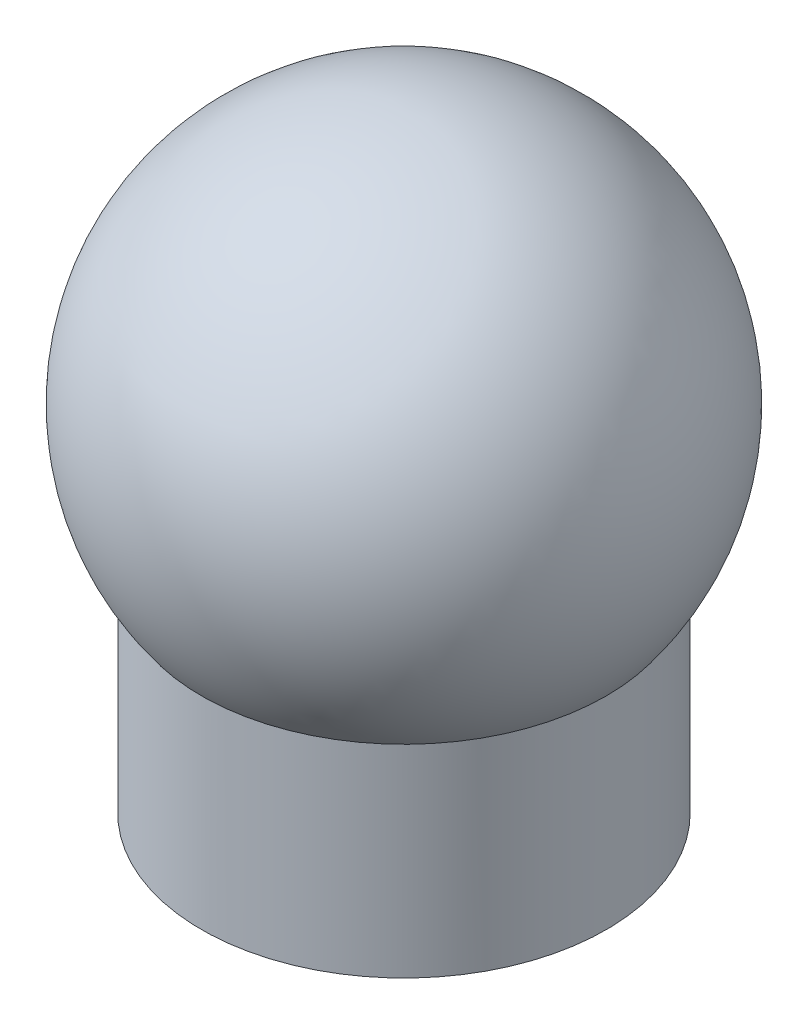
ISO-10303-21;
HEADER;
FILE_DESCRIPTION(('STEP AP214'),'2;1');
FILE_NAME('part.step','',(''),(''),'','','');
FILE_SCHEMA(('AUTOMOTIVE_DESIGN { 1 0 10303 214 1 1 1 1 }'));
ENDSEC;
DATA;
#1=APPLICATION_CONTEXT('core data for automotive mechanical design processes');
#2=APPLICATION_PROTOCOL_DEFINITION('international standard','automotive_design',2000,#1);
#3=PRODUCT_CONTEXT('',#1,'mechanical');
#4=PRODUCT('Part','Part','',(#3));
#5=PRODUCT_RELATED_PRODUCT_CATEGORY('part','',(#4));
#6=PRODUCT_DEFINITION_FORMATION('','',#4);
#7=PRODUCT_DEFINITION_CONTEXT('part definition',#1,'design');
#8=PRODUCT_DEFINITION('design','',#6,#7);
#9=PRODUCT_DEFINITION_SHAPE('','',#8);
#10=(LENGTH_UNIT() NAMED_UNIT(*) SI_UNIT(.MILLI.,.METRE.));
#11=(NAMED_UNIT(*) PLANE_ANGLE_UNIT() SI_UNIT($,.RADIAN.));
#12=(NAMED_UNIT(*) SI_UNIT($,.STERADIAN.) SOLID_ANGLE_UNIT());
#13=UNCERTAINTY_MEASURE_WITH_UNIT(LENGTH_MEASURE(1.E-05),#10,'distance_accuracy_value','');
#14=(GEOMETRIC_REPRESENTATION_CONTEXT(3) GLOBAL_UNCERTAINTY_ASSIGNED_CONTEXT((#13)) GLOBAL_UNIT_ASSIGNED_CONTEXT((#10,
#11,#12)) REPRESENTATION_CONTEXT('',''));
#15=CARTESIAN_POINT('',(0.,0.,0.));
#16=DIRECTION('',(0.,0.,1.));
#17=DIRECTION('',(1.,0.,0.));
#18=AXIS2_PLACEMENT_3D('',#15,#16,#17);
#19=CARTESIAN_POINT('',(0.,0.,0.));
#20=DIRECTION('',(0.,-1.,0.));
#21=DIRECTION('',(0.,0.,-1.));
#22=AXIS2_PLACEMENT_3D('',#19,#20,#21);
#23=PLANE('',#22);
#24=CARTESIAN_POINT('',(0.,0.,0.));
#25=DIRECTION('',(0.,-1.,0.));
#26=DIRECTION('',(0.,0.,-1.));
#27=AXIS2_PLACEMENT_3D('',#24,#25,#26);
#28=CIRCLE('',#27,5.08);
#29=CARTESIAN_POINT('',(0.,0.,-5.08));
#30=VERTEX_POINT('',#29);
#31=EDGE_CURVE('E10',#30,#30,#28,.T.);
#32=ORIENTED_EDGE('',*,*,#31,.T.);
#33=EDGE_LOOP('',(#32));
#34=FACE_BOUND('',#33,.T.);
#35=ADVANCED_FACE('F26',(#34),#23,.T.);
#36=CARTESIAN_POINT('',(0.,0.,0.));
#37=DIRECTION('',(0.,-1.,0.));
#38=DIRECTION('',(0.,0.,-1.));
#39=AXIS2_PLACEMENT_3D('',#36,#37,#38);
#40=CYLINDRICAL_SURFACE('',#39,5.08);
#41=CARTESIAN_POINT('',(0.,5.08,0.));
#42=DIRECTION('',(0.,-1.,0.));
#43=DIRECTION('',(0.,0.,-1.));
#44=AXIS2_PLACEMENT_3D('',#41,#42,#43);
#45=CIRCLE('',#44,5.08);
#46=CARTESIAN_POINT('',(0.,5.08,-5.08));
#47=VERTEX_POINT('',#46);
#48=EDGE_CURVE('E32',#47,#47,#45,.T.);
#49=ORIENTED_EDGE('',*,*,#48,.T.);
#50=EDGE_LOOP('',(#49));
#51=FACE_BOUND('',#50,.T.);
#52=ORIENTED_EDGE('',*,*,#31,.F.);
#53=EDGE_LOOP('',(#52));
#54=FACE_BOUND('',#53,.T.);
#55=ADVANCED_FACE('F38',(#51,#54),#40,.T.);
#56=CARTESIAN_POINT('',(0.,8.89,0.));
#57=DIRECTION('',(0.,-1.,0.));
#58=DIRECTION('',(1.,0.,0.));
#59=AXIS2_PLACEMENT_3D('',#56,#57,#58);
#60=SPHERICAL_SURFACE('',#59,6.35);
#61=ORIENTED_EDGE('',*,*,#48,.F.);
#62=EDGE_LOOP('',(#61));
#63=FACE_BOUND('',#62,.T.);
#64=ADVANCED_FACE('F41',(#63),#60,.T.);
#65=CLOSED_SHELL('',(#35,#55,#64));
#66=MANIFOLD_SOLID_BREP('B2',#65);
#67=ADVANCED_BREP_SHAPE_REPRESENTATION('',(#18,#66),#14);
#68=SHAPE_DEFINITION_REPRESENTATION(#9,#67);
ENDSEC;
END-ISO-10303-21;
